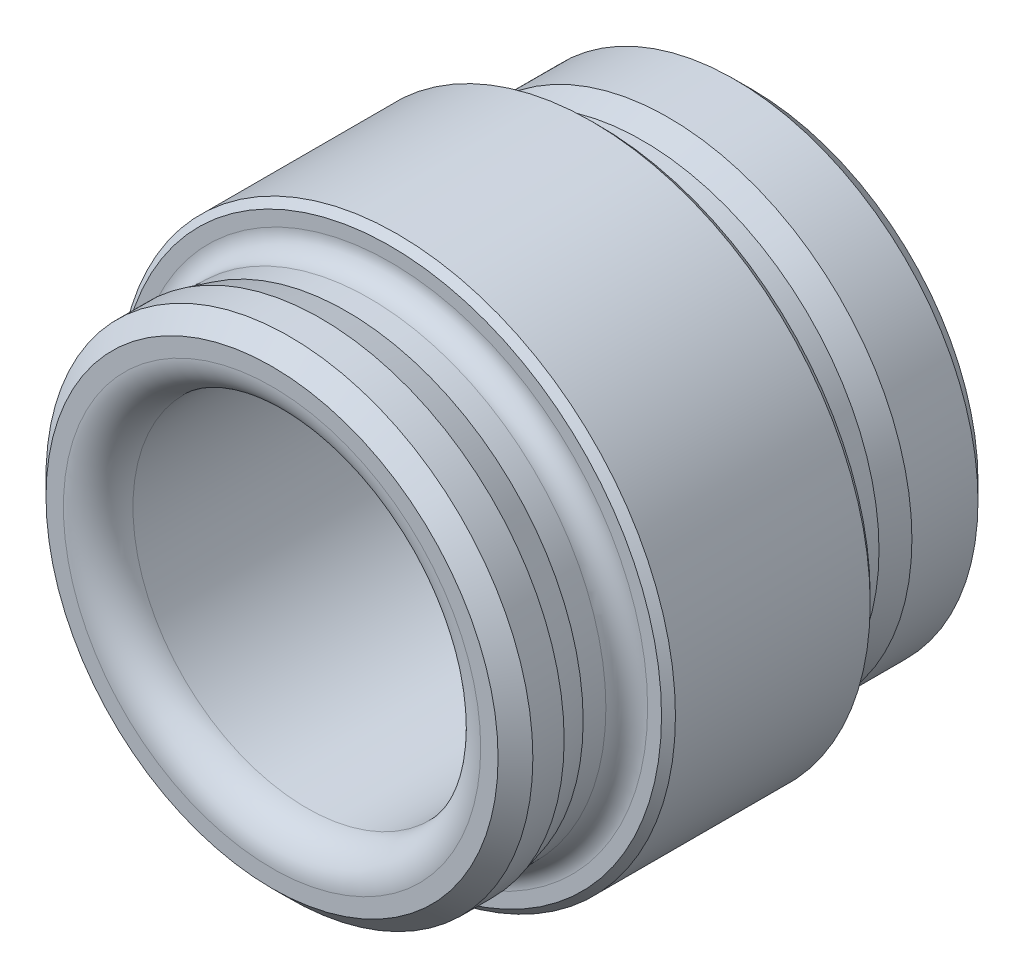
from build123d import *


with BuildPart() as part:
    # Sketch1 → Revolve1 (revolve)
    with BuildSketch(Plane(origin=(0, 0, 0), x_dir=(0, 0, -1), z_dir=(1, 0, 0)), mode=Mode.PRIVATE) as revolve1_sk:
        with BuildLine():
            Line((-9.4, 6.5), (-8.9, 7))
            Line((-8.9, 7), (-8, 7))
            Line((-8, 7), (-7.253589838, 6.8))
            Line((-7.253589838, 6.8), (-6.6, 6.8))
            ThreePointArc((-6.6, 6.8), (-6.175735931, 6.975735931), (-6, 7.4))
            Line((-6, 7.4), (-6, 7.8))
            Line((-6, 7.8), (-5.8, 8))
            Line((-5.8, 8), (-0.2, 8))
            Line((-0.2, 8), (0, 7.8))
            Line((0, 7.8), (0, 7.4))
            ThreePointArc((0, 7.4), (0.175735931, 6.975735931), (0.6, 6.8))
            Line((0.6, 6.8), (1.253589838, 6.8))
            Line((1.253589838, 6.8), (2, 7))
            Line((2, 7), (3.9, 7))
            Line((3.9, 7), (4.4, 6.5))
            Line((4.4, 6.5), (4.4, 5))
            Line((4.4, 5), (-8.4, 5))
            ThreePointArc((-8.4, 5), (-9.107106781, 5.292893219), (-9.4, 6))
            Line((-9.4, 6), (-9.4, 6.5))
        make_face()
    revolve(revolve1_sk.sketch.rotate(Axis((0, 0, 9.4), (0, 0, -1)), 90), axis=Axis((0, 0, 9.4), (0, 0, -1)))


solid = part.part
